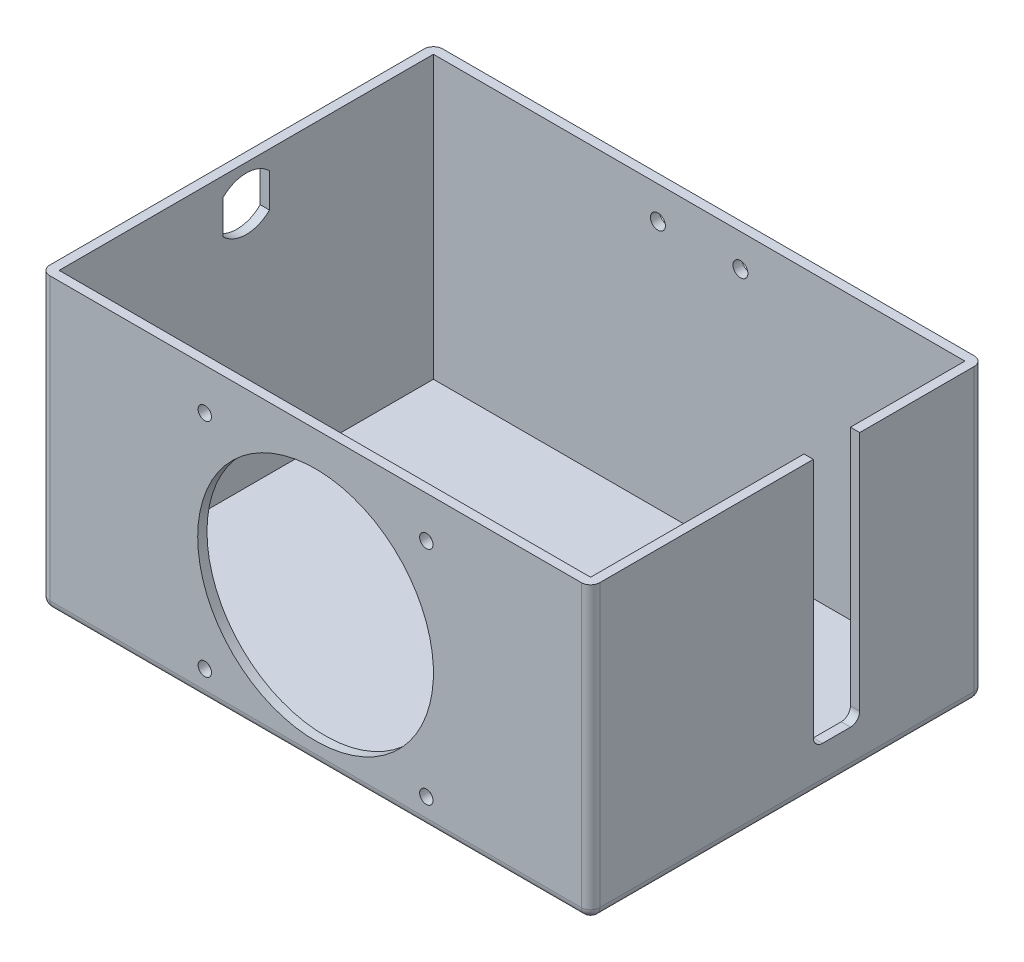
from build123d import *

# Parameters (mm, degrees)
SKETCH1_W                 = 177.8
SKETCH1_H                 = 127
BOSS_EXTRUDE1_DEPTH       = 93.98
SKETCH2_W                 = 171.8
SKETCH2_H                 = 121
CUT_EXTRUDE1_DEPTH        = 90.98
SKETCH3_W                 = 15
SKETCH3_H                 = 80.98
CUT_EXTRUDE2_DEPTH        = 209.373535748
CUT_EXTRUDE3_DEPTH        = 209.373535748
M4_CLEARANCE_HOLE1_D      = 4.318
M4_CLEARANCE_HOLE1_DEPTH  = 3
M72_CLEARANCE_HOLE1_D     = 76.2
M72_CLEARANCE_HOLE1_DEPTH = 3
FILLET1_R                 = 3
SKETCH9_R                 = 2.413
CUT_EXTRUDE4_DEPTH        = 3


with BuildPart() as part:
    # Sketch1 → Boss-Extrude1 (new body)
    with BuildSketch(Plane(origin=(0, 93.98, 0), x_dir=(1, 0, 0), z_dir=(0, 1, 0))):
        Rectangle(SKETCH1_W, SKETCH1_H)
    extrude(amount=-BOSS_EXTRUDE1_DEPTH)

    # Sketch2 → Cut-Extrude1 (cut)
    with BuildSketch(Plane(origin=(0, 93.98, 0), x_dir=(-1, 0, 0), z_dir=(0, 1, 0))):
        Rectangle(SKETCH2_W, SKETCH2_H)
    extrude(amount=-CUT_EXTRUDE1_DEPTH, mode=Mode.SUBTRACT)

    # Sketch3 → Cut-Extrude2 (cut, through all)
    with BuildSketch(Plane.ZY.offset(-85.9)):
        with Locations((-16, 53.49)):
            Rectangle(SKETCH3_W, SKETCH3_H)
    extrude(amount=-CUT_EXTRUDE2_DEPTH, mode=Mode.SUBTRACT)

    # Sketch4 → Cut-Extrude3 (cut, through all)
    with BuildSketch(Plane(origin=(-85.9, 0, 0), x_dir=(0, 0, -1), z_dir=(1, 0, 0))):
        with BuildLine():
            Line((7.5, 76.873398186), (7.5, 87.873398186))
            ThreePointArc((7.5, 87.873398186), (0, 90.979999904), (-7.5, 87.873398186))
            Line((-7.5, 87.873398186), (-7.5, 76.873398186))
            ThreePointArc((-7.5, 76.873398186), (0, 73.766796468), (7.5, 76.873398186))
        make_face()
    extrude(amount=-CUT_EXTRUDE3_DEPTH, mode=Mode.SUBTRACT)

    # M4 Clearance Hole1
    with Locations(Plane(origin=(0, 0, 60.5), x_dir=(-1, 0, 0), z_dir=(0, 0, -1))):
        with Locations((35.809, 80.604), (-35.809, 8.986), (35.809, 8.986), (-35.809, 80.604)):
            Hole(M4_CLEARANCE_HOLE1_D / 2, depth=M4_CLEARANCE_HOLE1_DEPTH)

    # M72 Clearance Hole1
    with Locations(Plane(origin=(0, 0, 60.5), x_dir=(-1, 0, 0), z_dir=(0, 0, -1))):
        with Locations((0, 44.795)):
            Hole(M72_CLEARANCE_HOLE1_D / 2, depth=M72_CLEARANCE_HOLE1_DEPTH)

    # Fillet1
    fillet1_edges = [part.edges().sort_by_distance(p)[0] for p in [
        (88.9, 0, 0),
        (0, 0, -63.5),
        (87.4, 13, -8.5),
        (87.4, 13, -23.5),
        (-88.9, 0, 0),
        (-88.9, 46.99, -63.5),
        (88.9, 46.99, -63.5),
        (88.9, 46.99, 63.5),
        (-88.9, 46.99, 63.5),
        (0, 0, 63.5),
    ]]
    fillet(fillet1_edges, radius=FILLET1_R)

    # Sketch9 → Cut-Extrude4 (cut)
    with BuildSketch(Plane(origin=(0, 0, -63.5), x_dir=(-1, 0, 0), z_dir=(0, 0, -1))):
        with Locations((-13.335, 83.439)):
            Circle(SKETCH9_R)
        with Locations((13.335, 83.439)):
            Circle(SKETCH9_R)
    extrude(amount=-CUT_EXTRUDE4_DEPTH, mode=Mode.SUBTRACT)


solid = part.part
